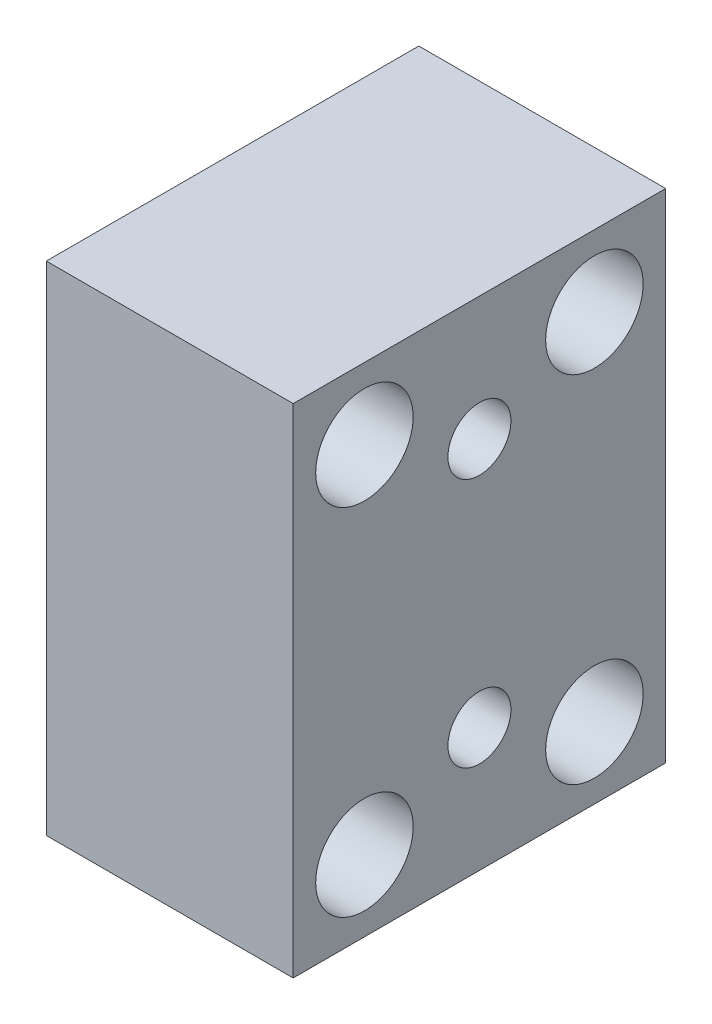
from build123d import *

# Parameters (mm, degrees)
SKETCH1_W                          = 25.0825
SKETCH1_H                          = 50.546
EXTRUDE1_DEPTH                     = 37.846
SKETCH7_W                          = 25.146
SKETCH7_H                          = 4.953
SKETCH9_W                          = 25.146
SKETCH9_H                          = 4.953
SKETCH10_R                         = 4.5593
CUT_EXTRUDE1_DEPTH                 = 12.573
SKETCH11_R                         = 4.5593
CUT_EXTRUDE2_DEPTH                 = 12.573
CUT_EXTRUDE3_DEPTH                 = 6.2865
CUT_EXTRUDE4_DEPTH                 = 6.2865
SKETCH8_W                          = 16.764
SKETCH8_H                          = 4.953
SKETCH18_W                         = 16.764
SKETCH18_H                         = 4.953
SKETCH16_W                         = 16.764
SKETCH16_H                         = 3.2004
SKETCH19_W                         = 16.764
SKETCH19_H                         = 3.2004
F_10_32_TAPPED_HOLE1_D             = 4.0386
F_10_32_TAPPED_HOLE1_DEPTH         = 15.0876
F_10_32_TAPPED_HOLE1_TIP           = 1.165843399
F_3_16_0_1875_DIAMETER_HOLE1_D     = 4.7625
F_3_16_0_1875_DIAMETER_HOLE1_DEPTH = 12.7
F_3_16_0_1875_DIAMETER_HOLE1_TIP   = 1.430799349


with BuildPart() as part:
    # Sketch1 → Extrude1 (new body)
    with BuildSketch(Plane.XY.offset(-18.923)):
        Rectangle(SKETCH1_W, SKETCH1_H)
    extrude(amount=EXTRUDE1_DEPTH)

    # Sketch7 → Cut-Revolve5 (revolve, cut)
    with BuildSketch(Plane.XY.offset(-11.684), mode=Mode.PRIVATE) as cut_revolve5_sk:
        with Locations((0, 20.5105)):
            Rectangle(SKETCH7_W, SKETCH7_H)
    revolve(cut_revolve5_sk.sketch.rotate(Axis((12.573, 18.034, -11.684), (-1, 0, 0)), 270), axis=Axis((12.573, 18.034, -11.684), (-1, 0, 0)), mode=Mode.SUBTRACT)

    # Sketch9 → Cut-Revolve6 (revolve, cut)
    with BuildSketch(Plane.XY.offset(11.684), mode=Mode.PRIVATE) as cut_revolve6_sk:
        with Locations((0, -15.5575)):
            Rectangle(SKETCH9_W, SKETCH9_H)
    revolve(cut_revolve6_sk.sketch.rotate(Axis((12.573, -18.034, 11.684), (-1, 0, 0)), 270), axis=Axis((12.573, -18.034, 11.684), (-1, 0, 0)), mode=Mode.SUBTRACT)

    # Sketch10 → Cut-Extrude1 (cut)
    with BuildSketch(Plane(origin=(-12.573, 0, 0), x_dir=(0, 0, -1), z_dir=(1, 0, 0))):
        with Locations(Location((-11.684, 18.034, 0), (0, 0, 90))):
            Circle(SKETCH10_R)
    extrude(amount=CUT_EXTRUDE1_DEPTH, mode=Mode.SUBTRACT)

    # Sketch11 → Cut-Extrude2 (cut)
    with BuildSketch(Plane(origin=(-12.573, 0, 0), x_dir=(0, 0, -1), z_dir=(1, 0, 0))):
        with Locations(Location((11.684, -18.034, 0), (0, 0, 90))):
            Circle(SKETCH11_R)
    extrude(amount=CUT_EXTRUDE2_DEPTH, mode=Mode.SUBTRACT)

    # Sketch12 → Revolve1 (revolve)
    with BuildSketch(Plane.XY.offset(-11.684), mode=Mode.PRIVATE) as revolve1_sk:
        with BuildLine():
            Line((-12.573, -18.034), (-12.573, -15.29842))
            ThreePointArc((-12.573, -15.29842), (-12.305922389, -14.653637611), (-11.66114, -14.38656))
            Line((-11.66114, -14.38656), (0, -14.38656))
            Line((0, -14.38656), (0, -18.034))
            Line((0, -18.034), (-12.573, -18.034))
        make_face()
    revolve(revolve1_sk.sketch.rotate(Axis((0, -18.034, -11.684), (-1, 0, 0)), 270), axis=Axis((0, -18.034, -11.684), (-1, 0, 0)))

    # Sketch13 → Cut-Extrude3 (cut)
    with BuildSketch(Plane(origin=(-12.573, 0, 0), x_dir=(0, 0, -1), z_dir=(1, 0, 0))):
        Polygon((10.414, -17.300765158), (10.414, -18.767234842), (11.684, -19.500469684), (12.954, -18.767234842), (12.954, -17.300765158), (11.684, -16.567530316), align=None)
    extrude(amount=CUT_EXTRUDE3_DEPTH, mode=Mode.SUBTRACT)

    # Sketch14 → Revolve2 (revolve)
    with BuildSketch(Plane.XY.offset(11.684), mode=Mode.PRIVATE) as revolve2_sk:
        with BuildLine():
            Line((-12.573, 18.034), (-12.573, 20.76958))
            ThreePointArc((-12.573, 20.76958), (-12.305922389, 21.414362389), (-11.66114, 21.68144))
            Line((-11.66114, 21.68144), (0, 21.68144))
            Line((0, 21.68144), (0, 18.034))
            Line((0, 18.034), (-12.573, 18.034))
        make_face()
    revolve(revolve2_sk.sketch.rotate(Axis((0, 18.034, 11.684), (-1, 0, 0)), 270), axis=Axis((0, 18.034, 11.684), (-1, 0, 0)))

    # Sketch15 → Cut-Extrude4 (cut)
    with BuildSketch(Plane(origin=(-12.573, 0, 0), x_dir=(0, 0, -1), z_dir=(1, 0, 0))):
        Polygon((-12.954, 18.767234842), (-12.954, 17.300765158), (-11.684, 16.567530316), (-10.414, 17.300765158), (-10.414, 18.767234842), (-11.684, 19.500469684), align=None)
    extrude(amount=CUT_EXTRUDE4_DEPTH, mode=Mode.SUBTRACT)

    # Sketch8 → Cut-Revolve9 (revolve, cut)
    with BuildSketch(Plane.XY.offset(-11.684), mode=Mode.PRIVATE) as cut_revolve9_sk:
        with Locations((12.573, -15.5575)):
            Rectangle(SKETCH8_W, SKETCH8_H)
    revolve(cut_revolve9_sk.sketch.rotate(Axis((20.955, -18.034, -11.684), (-1, 0, 0)), 270), axis=Axis((20.955, -18.034, -11.684), (-1, 0, 0)), mode=Mode.SUBTRACT)

    # Sketch18 → Cut-Revolve10 (revolve, cut)
    with BuildSketch(Plane.XY.offset(11.684), mode=Mode.PRIVATE) as cut_revolve10_sk:
        with Locations((12.573, 20.5105)):
            Rectangle(SKETCH18_W, SKETCH18_H)
    revolve(cut_revolve10_sk.sketch.rotate(Axis((20.955, 18.034, 11.684), (-1, 0, 0)), 270), axis=Axis((20.955, 18.034, 11.684), (-1, 0, 0)), mode=Mode.SUBTRACT)

    # Sketch16 → Cut-Revolve11 (revolve, cut)
    with BuildSketch(Plane.XY, mode=Mode.PRIVATE) as cut_revolve11_sk:
        with Locations((12.573, -11.0998)):
            Rectangle(SKETCH16_W, SKETCH16_H)
    revolve(cut_revolve11_sk.sketch.rotate(Axis((20.955, -12.7, 0), (-1, 0, 0)), 270), axis=Axis((20.955, -12.7, 0), (-1, 0, 0)), mode=Mode.SUBTRACT)

    # Sketch19 → Cut-Revolve12 (revolve, cut)
    with BuildSketch(Plane.XY, mode=Mode.PRIVATE) as cut_revolve12_sk:
        with Locations((12.573, 14.3002)):
            Rectangle(SKETCH19_W, SKETCH19_H)
    revolve(cut_revolve12_sk.sketch.rotate(Axis((20.955, 12.7, 0), (-1, 0, 0)), 270), axis=Axis((20.955, 12.7, 0), (-1, 0, 0)), mode=Mode.SUBTRACT)

    # 10-32 Tapped Hole1
    with Locations(Plane.ZY.offset(12.54125)):
        with Locations((0, 20.6375), (-11.1125, 0), (11.1125, 0), (0, -20.6375)):
            Hole(F_10_32_TAPPED_HOLE1_D / 2, depth=F_10_32_TAPPED_HOLE1_DEPTH)
            with Locations((0, 0, -(F_10_32_TAPPED_HOLE1_DEPTH + F_10_32_TAPPED_HOLE1_TIP / 2))):  # 120° drill point
                Cone(0, F_10_32_TAPPED_HOLE1_D / 2, F_10_32_TAPPED_HOLE1_TIP, mode=Mode.SUBTRACT)

    # 3_16 _0.1875_ Diameter Hole1
    with Locations(Plane.ZY.offset(12.54125)):
        with Locations((0, 12.7), (0, -12.7)):
            Hole(F_3_16_0_1875_DIAMETER_HOLE1_D / 2, depth=F_3_16_0_1875_DIAMETER_HOLE1_DEPTH)
            with Locations((0, 0, -(F_3_16_0_1875_DIAMETER_HOLE1_DEPTH + F_3_16_0_1875_DIAMETER_HOLE1_TIP / 2))):  # 118° drill point
                Cone(0, F_3_16_0_1875_DIAMETER_HOLE1_D / 2, F_3_16_0_1875_DIAMETER_HOLE1_TIP, mode=Mode.SUBTRACT)


solid = part.part
